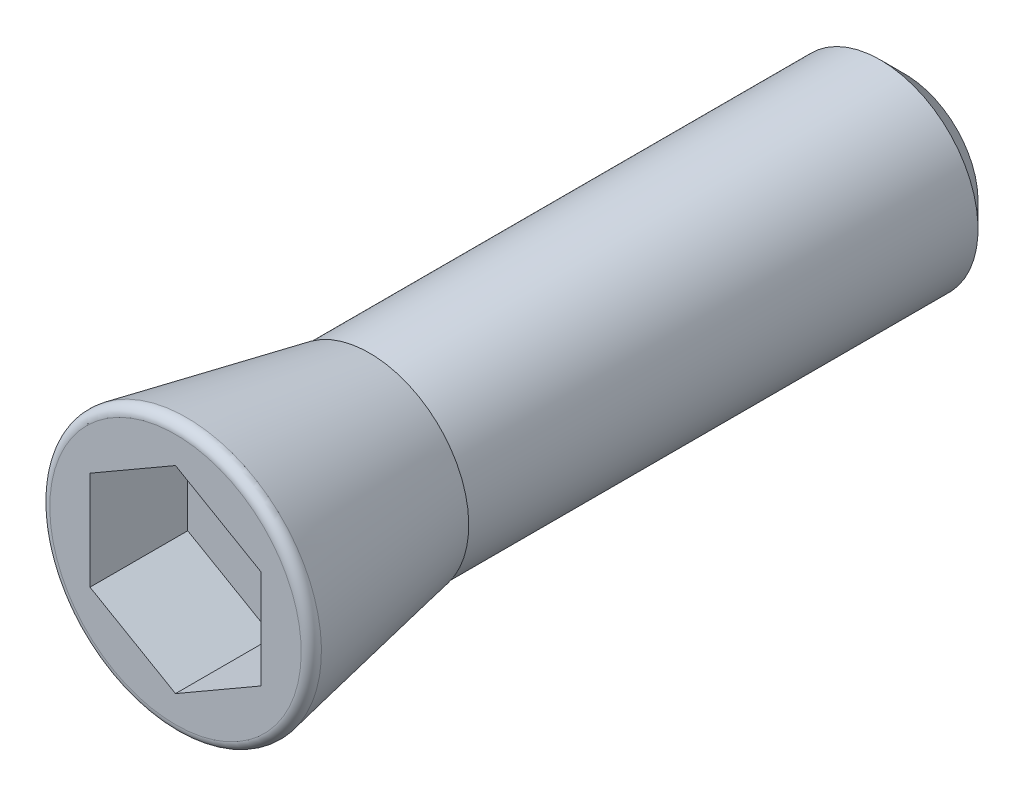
ISO-10303-21;
HEADER;
FILE_DESCRIPTION(('STEP AP214'),'2;1');
FILE_NAME('part.step','',(''),(''),'','','');
FILE_SCHEMA(('AUTOMOTIVE_DESIGN { 1 0 10303 214 1 1 1 1 }'));
ENDSEC;
DATA;
#1=APPLICATION_CONTEXT('core data for automotive mechanical design processes');
#2=APPLICATION_PROTOCOL_DEFINITION('international standard','automotive_design',2000,#1);
#3=PRODUCT_CONTEXT('',#1,'mechanical');
#4=PRODUCT('Part','Part','',(#3));
#5=PRODUCT_RELATED_PRODUCT_CATEGORY('part','',(#4));
#6=PRODUCT_DEFINITION_FORMATION('','',#4);
#7=PRODUCT_DEFINITION_CONTEXT('part definition',#1,'design');
#8=PRODUCT_DEFINITION('design','',#6,#7);
#9=PRODUCT_DEFINITION_SHAPE('','',#8);
#10=(LENGTH_UNIT() NAMED_UNIT(*) SI_UNIT(.MILLI.,.METRE.));
#11=(NAMED_UNIT(*) PLANE_ANGLE_UNIT() SI_UNIT($,.RADIAN.));
#12=(NAMED_UNIT(*) SI_UNIT($,.STERADIAN.) SOLID_ANGLE_UNIT());
#13=UNCERTAINTY_MEASURE_WITH_UNIT(LENGTH_MEASURE(1.E-05),#10,'distance_accuracy_value','');
#14=(GEOMETRIC_REPRESENTATION_CONTEXT(3) GLOBAL_UNCERTAINTY_ASSIGNED_CONTEXT((#13)) GLOBAL_UNIT_ASSIGNED_CONTEXT((#10,
#11,#12)) REPRESENTATION_CONTEXT('',''));
#15=CARTESIAN_POINT('',(0.,0.,0.));
#16=DIRECTION('',(0.,0.,1.));
#17=DIRECTION('',(1.,0.,0.));
#18=AXIS2_PLACEMENT_3D('',#15,#16,#17);
#19=CARTESIAN_POINT('',(0.,7.9375,-15.875));
#20=DIRECTION('',(0.,0.,1.));
#21=DIRECTION('',(0.,-1.,0.));
#22=AXIS2_PLACEMENT_3D('',#19,#20,#21);
#23=PLANE('',#22);
#24=CARTESIAN_POINT('',(0.,0.,-15.875));
#25=DIRECTION('',(0.,0.,1.));
#26=DIRECTION('',(0.,-1.,0.));
#27=AXIS2_PLACEMENT_3D('',#24,#25,#26);
#28=CIRCLE('',#27,8.);
#29=CARTESIAN_POINT('',(0.,-8.,-15.875));
#30=VERTEX_POINT('',#29);
#31=EDGE_CURVE('E117',#30,#30,#28,.T.);
#32=ORIENTED_EDGE('',*,*,#31,.T.);
#33=EDGE_LOOP('',(#32));
#34=FACE_BOUND('',#33,.T.);
#35=CARTESIAN_POINT('',(0.,0.,-15.875));
#36=DIRECTION('',(0.,0.,1.));
#37=DIRECTION('',(0.,-1.,0.));
#38=AXIS2_PLACEMENT_3D('',#35,#36,#37);
#39=CIRCLE('',#38,8.128);
#40=CARTESIAN_POINT('',(0.,-8.128,-15.875));
#41=VERTEX_POINT('',#40);
#42=EDGE_CURVE('E130',#41,#41,#39,.T.);
#43=ORIENTED_EDGE('',*,*,#42,.F.);
#44=EDGE_LOOP('',(#43));
#45=FACE_BOUND('',#44,.T.);
#46=ADVANCED_FACE('F14',(#34,#45),#23,.F.);
#47=CARTESIAN_POINT('',(0.,0.,-15.875));
#48=DIRECTION('',(0.,0.,1.));
#49=DIRECTION('',(0.,-1.,0.));
#50=AXIS2_PLACEMENT_3D('',#47,#48,#49);
#51=CONICAL_SURFACE('',#50,8.128,0.191986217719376);
#52=CARTESIAN_POINT('',(0.,0.,-0.907396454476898));
#53=DIRECTION('',(0.,0.,1.));
#54=DIRECTION('',(0.,-1.,0.));
#55=AXIS2_PLACEMENT_3D('',#52,#53,#54);
#56=CIRCLE('',#55,11.0374074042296);
#57=CARTESIAN_POINT('',(0.,-11.0374074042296,-0.907396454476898));
#58=VERTEX_POINT('',#57);
#59=EDGE_CURVE('E127',#58,#58,#56,.T.);
#60=ORIENTED_EDGE('',*,*,#59,.F.);
#61=EDGE_LOOP('',(#60));
#62=FACE_BOUND('',#61,.T.);
#63=ORIENTED_EDGE('',*,*,#42,.T.);
#64=EDGE_LOOP('',(#63));
#65=FACE_BOUND('',#64,.T.);
#66=ADVANCED_FACE('F151',(#62,#65),#51,.T.);
#67=CARTESIAN_POINT('',(0.,0.,-0.762));
#68=DIRECTION('',(0.,0.,1.));
#69=DIRECTION('',(0.,-1.,0.));
#70=AXIS2_PLACEMENT_3D('',#67,#68,#69);
#71=TOROIDAL_SURFACE('',#70,10.2894074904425,0.762);
#72=CARTESIAN_POINT('',(0.,0.,0.));
#73=DIRECTION('',(0.,0.,1.));
#74=DIRECTION('',(0.,-1.,0.));
#75=AXIS2_PLACEMENT_3D('',#72,#73,#74);
#76=CIRCLE('',#75,10.2894074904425);
#77=CARTESIAN_POINT('',(0.,-10.2894074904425,0.));
#78=VERTEX_POINT('',#77);
#79=EDGE_CURVE('E124',#78,#78,#76,.T.);
#80=ORIENTED_EDGE('',*,*,#79,.F.);
#81=EDGE_LOOP('',(#80));
#82=FACE_BOUND('',#81,.T.);
#83=ORIENTED_EDGE('',*,*,#59,.T.);
#84=EDGE_LOOP('',(#83));
#85=FACE_BOUND('',#84,.T.);
#86=ADVANCED_FACE('F159',(#82,#85),#71,.T.);
#87=CARTESIAN_POINT('',(0.,0.,0.));
#88=DIRECTION('',(0.,0.,-1.));
#89=DIRECTION('',(0.,1.,0.));
#90=AXIS2_PLACEMENT_3D('',#87,#88,#89);
#91=PLANE('',#90);
#92=DIRECTION('',(0.866025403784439,0.5,0.));
#93=VECTOR('',#92,1.);
#94=CARTESIAN_POINT('',(0.,-8.08290376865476,0.));
#95=LINE('',#94,#93);
#96=CARTESIAN_POINT('',(0.,-8.08290376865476,0.));
#97=VERTEX_POINT('',#96);
#98=CARTESIAN_POINT('',(7.,-4.04145188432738,0.));
#99=VERTEX_POINT('',#98);
#100=EDGE_CURVE('E83',#97,#99,#95,.T.);
#101=ORIENTED_EDGE('',*,*,#100,.F.);
#102=DIRECTION('',(0.866025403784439,-0.5,0.));
#103=VECTOR('',#102,1.);
#104=CARTESIAN_POINT('',(-7.,-4.04145188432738,0.));
#105=LINE('',#104,#103);
#106=CARTESIAN_POINT('',(-7.,-4.04145188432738,0.));
#107=VERTEX_POINT('',#106);
#108=EDGE_CURVE('E29',#107,#97,#105,.T.);
#109=ORIENTED_EDGE('',*,*,#108,.F.);
#110=DIRECTION('',(0.,-1.,0.));
#111=VECTOR('',#110,1.);
#112=CARTESIAN_POINT('',(-7.,4.04145188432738,0.));
#113=LINE('',#112,#111);
#114=CARTESIAN_POINT('',(-7.,4.04145188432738,0.));
#115=VERTEX_POINT('',#114);
#116=EDGE_CURVE('E99',#115,#107,#113,.T.);
#117=ORIENTED_EDGE('',*,*,#116,.F.);
#118=DIRECTION('',(-0.866025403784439,-0.5,0.));
#119=VECTOR('',#118,1.);
#120=CARTESIAN_POINT('',(0.,8.08290376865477,0.));
#121=LINE('',#120,#119);
#122=CARTESIAN_POINT('',(0.,8.08290376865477,0.));
#123=VERTEX_POINT('',#122);
#124=EDGE_CURVE('E93',#123,#115,#121,.T.);
#125=ORIENTED_EDGE('',*,*,#124,.F.);
#126=DIRECTION('',(-0.866025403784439,0.5,0.));
#127=VECTOR('',#126,1.);
#128=CARTESIAN_POINT('',(7.,4.04145188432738,0.));
#129=LINE('',#128,#127);
#130=CARTESIAN_POINT('',(7.,4.04145188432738,0.));
#131=VERTEX_POINT('',#130);
#132=EDGE_CURVE('E91',#131,#123,#129,.T.);
#133=ORIENTED_EDGE('',*,*,#132,.F.);
#134=DIRECTION('',(0.,1.,0.));
#135=VECTOR('',#134,1.);
#136=CARTESIAN_POINT('',(7.,-4.04145188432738,0.));
#137=LINE('',#136,#135);
#138=EDGE_CURVE('E72',#99,#131,#137,.T.);
#139=ORIENTED_EDGE('',*,*,#138,.F.);
#140=EDGE_LOOP('',(#101,#109,#117,#125,#133,#139));
#141=FACE_BOUND('',#140,.T.);
#142=ORIENTED_EDGE('',*,*,#79,.T.);
#143=EDGE_LOOP('',(#142));
#144=FACE_BOUND('',#143,.T.);
#145=ADVANCED_FACE('F87',(#141,#144),#91,.F.);
#146=CARTESIAN_POINT('',(0.,0.,-9.69));
#147=DIRECTION('',(0.,0.,-1.));
#148=DIRECTION('',(0.,1.,0.));
#149=AXIS2_PLACEMENT_3D('',#146,#147,#148);
#150=CYLINDRICAL_SURFACE('',#149,8.);
#151=CARTESIAN_POINT('',(0.,0.,-57.69));
#152=DIRECTION('',(0.,0.,1.));
#153=DIRECTION('',(0.,-1.,0.));
#154=AXIS2_PLACEMENT_3D('',#151,#152,#153);
#155=CIRCLE('',#154,8.);
#156=CARTESIAN_POINT('',(0.,-8.,-57.69));
#157=VERTEX_POINT('',#156);
#158=EDGE_CURVE('E9',#157,#157,#155,.T.);
#159=ORIENTED_EDGE('',*,*,#158,.T.);
#160=EDGE_LOOP('',(#159));
#161=FACE_BOUND('',#160,.T.);
#162=ORIENTED_EDGE('',*,*,#31,.F.);
#163=EDGE_LOOP('',(#162));
#164=FACE_BOUND('',#163,.T.);
#165=ADVANCED_FACE('F166',(#161,#164),#150,.T.);
#166=CARTESIAN_POINT('',(0.,0.,-59.69));
#167=DIRECTION('',(0.,0.,1.));
#168=DIRECTION('',(0.,-1.,0.));
#169=AXIS2_PLACEMENT_3D('',#166,#167,#168);
#170=PLANE('',#169);
#171=CARTESIAN_POINT('',(0.,0.,-59.69));
#172=DIRECTION('',(0.,0.,1.));
#173=DIRECTION('',(0.,-1.,0.));
#174=AXIS2_PLACEMENT_3D('',#171,#172,#173);
#175=CIRCLE('',#174,6.);
#176=CARTESIAN_POINT('',(0.,-6.,-59.69));
#177=VERTEX_POINT('',#176);
#178=EDGE_CURVE('E22',#177,#177,#175,.F.);
#179=ORIENTED_EDGE('',*,*,#178,.T.);
#180=EDGE_LOOP('',(#179));
#181=FACE_BOUND('',#180,.T.);
#182=ADVANCED_FACE('F137',(#181),#170,.F.);
#183=CARTESIAN_POINT('',(-7.,-4.04145188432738,-8.));
#184=DIRECTION('',(-0.5,-0.866025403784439,0.));
#185=DIRECTION('',(0.866025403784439,-0.5,0.));
#186=AXIS2_PLACEMENT_3D('',#183,#184,#185);
#187=PLANE('',#186);
#188=ORIENTED_EDGE('',*,*,#108,.T.);
#189=DIRECTION('',(0.,0.,1.));
#190=VECTOR('',#189,1.);
#191=CARTESIAN_POINT('',(0.,-8.08290376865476,-8.));
#192=LINE('',#191,#190);
#193=CARTESIAN_POINT('',(0.,-8.08290376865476,-8.));
#194=VERTEX_POINT('',#193);
#195=EDGE_CURVE('E80',#194,#97,#192,.T.);
#196=ORIENTED_EDGE('',*,*,#195,.F.);
#197=DIRECTION('',(0.866025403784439,-0.5,0.));
#198=VECTOR('',#197,1.);
#199=CARTESIAN_POINT('',(-7.,-4.04145188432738,-8.));
#200=LINE('',#199,#198);
#201=CARTESIAN_POINT('',(-7.,-4.04145188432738,-8.));
#202=VERTEX_POINT('',#201);
#203=EDGE_CURVE('E101',#202,#194,#200,.T.);
#204=ORIENTED_EDGE('',*,*,#203,.F.);
#205=DIRECTION('',(0.,0.,1.));
#206=VECTOR('',#205,1.);
#207=CARTESIAN_POINT('',(-7.,-4.04145188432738,-8.));
#208=LINE('',#207,#206);
#209=EDGE_CURVE('E36',#202,#107,#208,.T.);
#210=ORIENTED_EDGE('',*,*,#209,.T.);
#211=EDGE_LOOP('',(#188,#196,#204,#210));
#212=FACE_BOUND('',#211,.T.);
#213=ADVANCED_FACE('F165',(#212),#187,.F.);
#214=CARTESIAN_POINT('',(-7.,4.04145188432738,-8.));
#215=DIRECTION('',(-1.,0.,0.));
#216=DIRECTION('',(0.,-1.,0.));
#217=AXIS2_PLACEMENT_3D('',#214,#215,#216);
#218=PLANE('',#217);
#219=ORIENTED_EDGE('',*,*,#116,.T.);
#220=ORIENTED_EDGE('',*,*,#209,.F.);
#221=DIRECTION('',(0.,-1.,0.));
#222=VECTOR('',#221,1.);
#223=CARTESIAN_POINT('',(-7.,4.04145188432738,-8.));
#224=LINE('',#223,#222);
#225=CARTESIAN_POINT('',(-7.,4.04145188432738,-8.));
#226=VERTEX_POINT('',#225);
#227=EDGE_CURVE('E113',#226,#202,#224,.T.);
#228=ORIENTED_EDGE('',*,*,#227,.F.);
#229=DIRECTION('',(0.,0.,1.));
#230=VECTOR('',#229,1.);
#231=CARTESIAN_POINT('',(-7.,4.04145188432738,-8.));
#232=LINE('',#231,#230);
#233=EDGE_CURVE('E118',#226,#115,#232,.T.);
#234=ORIENTED_EDGE('',*,*,#233,.T.);
#235=EDGE_LOOP('',(#219,#220,#228,#234));
#236=FACE_BOUND('',#235,.T.);
#237=ADVANCED_FACE('F172',(#236),#218,.F.);
#238=CARTESIAN_POINT('',(0.,8.08290376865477,-8.));
#239=DIRECTION('',(-0.5,0.866025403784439,0.));
#240=DIRECTION('',(-0.866025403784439,-0.5,0.));
#241=AXIS2_PLACEMENT_3D('',#238,#239,#240);
#242=PLANE('',#241);
#243=ORIENTED_EDGE('',*,*,#124,.T.);
#244=ORIENTED_EDGE('',*,*,#233,.F.);
#245=DIRECTION('',(-0.866025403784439,-0.5,0.));
#246=VECTOR('',#245,1.);
#247=CARTESIAN_POINT('',(0.,8.08290376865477,-8.));
#248=LINE('',#247,#246);
#249=CARTESIAN_POINT('',(0.,8.08290376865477,-8.));
#250=VERTEX_POINT('',#249);
#251=EDGE_CURVE('E110',#250,#226,#248,.T.);
#252=ORIENTED_EDGE('',*,*,#251,.F.);
#253=DIRECTION('',(0.,0.,1.));
#254=VECTOR('',#253,1.);
#255=CARTESIAN_POINT('',(0.,8.08290376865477,-8.));
#256=LINE('',#255,#254);
#257=EDGE_CURVE('E120',#250,#123,#256,.T.);
#258=ORIENTED_EDGE('',*,*,#257,.T.);
#259=EDGE_LOOP('',(#243,#244,#252,#258));
#260=FACE_BOUND('',#259,.T.);
#261=ADVANCED_FACE('F263',(#260),#242,.F.);
#262=CARTESIAN_POINT('',(7.,4.04145188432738,-8.));
#263=DIRECTION('',(0.5,0.866025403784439,0.));
#264=DIRECTION('',(-0.866025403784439,0.5,0.));
#265=AXIS2_PLACEMENT_3D('',#262,#263,#264);
#266=PLANE('',#265);
#267=ORIENTED_EDGE('',*,*,#132,.T.);
#268=ORIENTED_EDGE('',*,*,#257,.F.);
#269=DIRECTION('',(-0.866025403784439,0.5,0.));
#270=VECTOR('',#269,1.);
#271=CARTESIAN_POINT('',(7.,4.04145188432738,-8.));
#272=LINE('',#271,#270);
#273=CARTESIAN_POINT('',(7.,4.04145188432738,-8.));
#274=VERTEX_POINT('',#273);
#275=EDGE_CURVE('E107',#274,#250,#272,.T.);
#276=ORIENTED_EDGE('',*,*,#275,.F.);
#277=DIRECTION('',(0.,0.,1.));
#278=VECTOR('',#277,1.);
#279=CARTESIAN_POINT('',(7.,4.04145188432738,-8.));
#280=LINE('',#279,#278);
#281=EDGE_CURVE('E79',#274,#131,#280,.T.);
#282=ORIENTED_EDGE('',*,*,#281,.T.);
#283=EDGE_LOOP('',(#267,#268,#276,#282));
#284=FACE_BOUND('',#283,.T.);
#285=ADVANCED_FACE('F255',(#284),#266,.F.);
#286=CARTESIAN_POINT('',(7.,-4.04145188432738,-8.));
#287=DIRECTION('',(1.,0.,0.));
#288=DIRECTION('',(0.,1.,0.));
#289=AXIS2_PLACEMENT_3D('',#286,#287,#288);
#290=PLANE('',#289);
#291=ORIENTED_EDGE('',*,*,#138,.T.);
#292=ORIENTED_EDGE('',*,*,#281,.F.);
#293=DIRECTION('',(0.,1.,0.));
#294=VECTOR('',#293,1.);
#295=CARTESIAN_POINT('',(7.,-4.04145188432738,-8.));
#296=LINE('',#295,#294);
#297=CARTESIAN_POINT('',(7.,-4.04145188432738,-8.));
#298=VERTEX_POINT('',#297);
#299=EDGE_CURVE('E75',#298,#274,#296,.T.);
#300=ORIENTED_EDGE('',*,*,#299,.F.);
#301=DIRECTION('',(0.,0.,1.));
#302=VECTOR('',#301,1.);
#303=CARTESIAN_POINT('',(7.,-4.04145188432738,-8.));
#304=LINE('',#303,#302);
#305=EDGE_CURVE('E68',#298,#99,#304,.T.);
#306=ORIENTED_EDGE('',*,*,#305,.T.);
#307=EDGE_LOOP('',(#291,#292,#300,#306));
#308=FACE_BOUND('',#307,.T.);
#309=ADVANCED_FACE('F70',(#308),#290,.F.);
#310=CARTESIAN_POINT('',(0.,-8.08290376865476,-8.));
#311=DIRECTION('',(0.5,-0.866025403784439,0.));
#312=DIRECTION('',(0.866025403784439,0.5,0.));
#313=AXIS2_PLACEMENT_3D('',#310,#311,#312);
#314=PLANE('',#313);
#315=ORIENTED_EDGE('',*,*,#100,.T.);
#316=ORIENTED_EDGE('',*,*,#305,.F.);
#317=DIRECTION('',(0.866025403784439,0.5,0.));
#318=VECTOR('',#317,1.);
#319=CARTESIAN_POINT('',(0.,-8.08290376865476,-8.));
#320=LINE('',#319,#318);
#321=EDGE_CURVE('E104',#194,#298,#320,.T.);
#322=ORIENTED_EDGE('',*,*,#321,.F.);
#323=ORIENTED_EDGE('',*,*,#195,.T.);
#324=EDGE_LOOP('',(#315,#316,#322,#323));
#325=FACE_BOUND('',#324,.T.);
#326=ADVANCED_FACE('F84',(#325),#314,.F.);
#327=CARTESIAN_POINT('',(7.,-12.1243556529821,-8.));
#328=DIRECTION('',(0.,0.,1.));
#329=DIRECTION('',(1.,0.,0.));
#330=AXIS2_PLACEMENT_3D('',#327,#328,#329);
#331=PLANE('',#330);
#332=ORIENTED_EDGE('',*,*,#203,.T.);
#333=ORIENTED_EDGE('',*,*,#321,.T.);
#334=ORIENTED_EDGE('',*,*,#299,.T.);
#335=ORIENTED_EDGE('',*,*,#275,.T.);
#336=ORIENTED_EDGE('',*,*,#251,.T.);
#337=ORIENTED_EDGE('',*,*,#227,.T.);
#338=EDGE_LOOP('',(#332,#333,#334,#335,#336,#337));
#339=FACE_BOUND('',#338,.T.);
#340=ADVANCED_FACE('F140',(#339),#331,.T.);
#341=CARTESIAN_POINT('',(0.,0.,-59.69));
#342=DIRECTION('',(0.,0.,1.));
#343=DIRECTION('',(0.,-1.,0.));
#344=AXIS2_PLACEMENT_3D('',#341,#342,#343);
#345=CONICAL_SURFACE('',#344,6.,0.785398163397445);
#346=ORIENTED_EDGE('',*,*,#158,.F.);
#347=EDGE_LOOP('',(#346));
#348=FACE_BOUND('',#347,.T.);
#349=ORIENTED_EDGE('',*,*,#178,.F.);
#350=EDGE_LOOP('',(#349));
#351=FACE_BOUND('',#350,.T.);
#352=ADVANCED_FACE('F16',(#348,#351),#345,.T.);
#353=CLOSED_SHELL('',(#46,#66,#86,#145,#165,#182,#213,#237,#261,#285,#309,#326,#340,#352));
#354=MANIFOLD_SOLID_BREP('B1',#353);
#355=ADVANCED_BREP_SHAPE_REPRESENTATION('',(#18,#354),#14);
#356=SHAPE_DEFINITION_REPRESENTATION(#9,#355);
ENDSEC;
END-ISO-10303-21;
